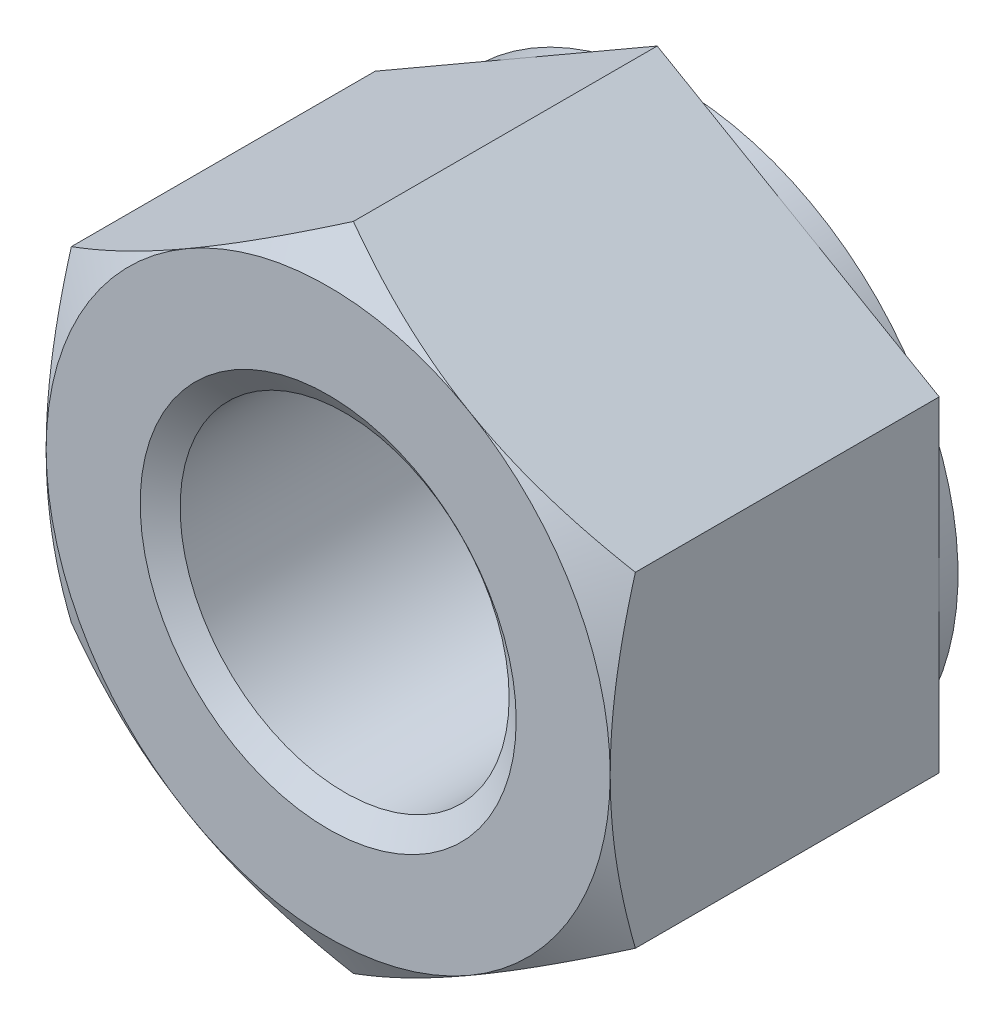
ISO-10303-21;
HEADER;
FILE_DESCRIPTION(('STEP AP214'),'2;1');
FILE_NAME('part.step','',(''),(''),'','','');
FILE_SCHEMA(('AUTOMOTIVE_DESIGN { 1 0 10303 214 1 1 1 1 }'));
ENDSEC;
DATA;
#1=APPLICATION_CONTEXT('core data for automotive mechanical design processes');
#2=APPLICATION_PROTOCOL_DEFINITION('international standard','automotive_design',2000,#1);
#3=PRODUCT_CONTEXT('',#1,'mechanical');
#4=PRODUCT('Part','Part','',(#3));
#5=PRODUCT_RELATED_PRODUCT_CATEGORY('part','',(#4));
#6=PRODUCT_DEFINITION_FORMATION('','',#4);
#7=PRODUCT_DEFINITION_CONTEXT('part definition',#1,'design');
#8=PRODUCT_DEFINITION('design','',#6,#7);
#9=PRODUCT_DEFINITION_SHAPE('','',#8);
#10=(LENGTH_UNIT() NAMED_UNIT(*) SI_UNIT(.MILLI.,.METRE.));
#11=(NAMED_UNIT(*) PLANE_ANGLE_UNIT() SI_UNIT($,.RADIAN.));
#12=(NAMED_UNIT(*) SI_UNIT($,.STERADIAN.) SOLID_ANGLE_UNIT());
#13=UNCERTAINTY_MEASURE_WITH_UNIT(LENGTH_MEASURE(1.E-05),#10,'distance_accuracy_value','');
#14=(GEOMETRIC_REPRESENTATION_CONTEXT(3) GLOBAL_UNCERTAINTY_ASSIGNED_CONTEXT((#13)) GLOBAL_UNIT_ASSIGNED_CONTEXT((#10,
#11,#12)) REPRESENTATION_CONTEXT('',''));
#15=CARTESIAN_POINT('',(0.,0.,0.));
#16=DIRECTION('',(0.,0.,1.));
#17=DIRECTION('',(1.,0.,0.));
#18=AXIS2_PLACEMENT_3D('',#15,#16,#17);
#19=CARTESIAN_POINT('',(0.,0.,-14.8));
#20=DIRECTION('',(0.,0.,1.));
#21=DIRECTION('',(1.,0.,0.));
#22=AXIS2_PLACEMENT_3D('',#19,#20,#21);
#23=CYLINDRICAL_SURFACE('',#22,7.);
#24=CARTESIAN_POINT('',(0.,0.,-0.700207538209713));
#25=DIRECTION('',(0.,0.,1.));
#26=DIRECTION('',(1.,0.,0.));
#27=AXIS2_PLACEMENT_3D('',#24,#25,#26);
#28=CIRCLE('',#27,7.);
#29=CARTESIAN_POINT('',(7.,0.,-0.700207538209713));
#30=VERTEX_POINT('',#29);
#31=EDGE_CURVE('E151',#30,#30,#28,.F.);
#32=ORIENTED_EDGE('',*,*,#31,.F.);
#33=EDGE_LOOP('',(#32));
#34=FACE_BOUND('',#33,.T.);
#35=CARTESIAN_POINT('',(0.,0.,-14.0743924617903));
#36=DIRECTION('',(0.,0.,-1.));
#37=DIRECTION('',(-1.,0.,0.));
#38=AXIS2_PLACEMENT_3D('',#35,#36,#37);
#39=CIRCLE('',#38,7.);
#40=CARTESIAN_POINT('',(-7.,0.,-14.0743924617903));
#41=VERTEX_POINT('',#40);
#42=EDGE_CURVE('E39',#41,#41,#39,.F.);
#43=ORIENTED_EDGE('',*,*,#42,.F.);
#44=EDGE_LOOP('',(#43));
#45=FACE_BOUND('',#44,.T.);
#46=ADVANCED_FACE('F34',(#34,#45),#23,.F.);
#47=CARTESIAN_POINT('',(0.,13.856406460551,-14.8));
#48=DIRECTION('',(0.,0.,-1.));
#49=DIRECTION('',(-1.,0.,0.));
#50=AXIS2_PLACEMENT_3D('',#47,#48,#49);
#51=PLANE('',#50);
#52=CARTESIAN_POINT('',(0.,0.,-14.8));
#53=DIRECTION('',(0.,0.,-1.));
#54=DIRECTION('',(-1.,0.,0.));
#55=AXIS2_PLACEMENT_3D('',#52,#53,#54);
#56=CIRCLE('',#55,12.);
#57=CARTESIAN_POINT('',(-12.,0.,-14.8));
#58=VERTEX_POINT('',#57);
#59=EDGE_CURVE('E278',#58,#58,#56,.F.);
#60=ORIENTED_EDGE('',*,*,#59,.F.);
#61=EDGE_LOOP('',(#60));
#62=FACE_BOUND('',#61,.T.);
#63=CARTESIAN_POINT('',(0.,0.,-14.8));
#64=DIRECTION('',(0.,0.,-1.));
#65=DIRECTION('',(-1.,0.,0.));
#66=AXIS2_PLACEMENT_3D('',#63,#64,#65);
#67=CIRCLE('',#66,8.);
#68=CARTESIAN_POINT('',(-8.,0.,-14.8));
#69=VERTEX_POINT('',#68);
#70=EDGE_CURVE('E298',#69,#69,#67,.F.);
#71=ORIENTED_EDGE('',*,*,#70,.T.);
#72=EDGE_LOOP('',(#71));
#73=FACE_BOUND('',#72,.T.);
#74=ADVANCED_FACE('F231',(#62,#73),#51,.T.);
#75=CARTESIAN_POINT('',(0.,13.856406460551,0.));
#76=DIRECTION('',(0.,0.,-1.));
#77=DIRECTION('',(-1.,0.,0.));
#78=AXIS2_PLACEMENT_3D('',#75,#76,#77);
#79=PLANE('',#78);
#80=CARTESIAN_POINT('',(0.,0.,0.));
#81=DIRECTION('',(0.,0.,-1.));
#82=DIRECTION('',(-1.,0.,0.));
#83=AXIS2_PLACEMENT_3D('',#80,#81,#82);
#84=CIRCLE('',#83,12.);
#85=CARTESIAN_POINT('',(-6.00000000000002,10.3923048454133,0.));
#86=VERTEX_POINT('',#85);
#87=CARTESIAN_POINT('',(-12.,0.,0.));
#88=VERTEX_POINT('',#87);
#89=EDGE_CURVE('E46',#86,#88,#84,.F.);
#90=ORIENTED_EDGE('',*,*,#89,.T.);
#91=CARTESIAN_POINT('',(-6.00000000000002,-10.3923048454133,0.));
#92=VERTEX_POINT('',#91);
#93=EDGE_CURVE('E12',#88,#92,#84,.F.);
#94=ORIENTED_EDGE('',*,*,#93,.T.);
#95=CARTESIAN_POINT('',(6.00000000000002,-10.3923048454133,0.));
#96=VERTEX_POINT('',#95);
#97=EDGE_CURVE('E44',#92,#96,#84,.F.);
#98=ORIENTED_EDGE('',*,*,#97,.T.);
#99=CARTESIAN_POINT('',(12.,0.,0.));
#100=VERTEX_POINT('',#99);
#101=EDGE_CURVE('E130',#96,#100,#84,.F.);
#102=ORIENTED_EDGE('',*,*,#101,.T.);
#103=CARTESIAN_POINT('',(0.,0.,0.));
#104=DIRECTION('',(0.,0.,1.));
#105=DIRECTION('',(1.,0.,0.));
#106=AXIS2_PLACEMENT_3D('',#103,#104,#105);
#107=CIRCLE('',#106,12.);
#108=CARTESIAN_POINT('',(6.00000000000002,10.3923048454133,0.));
#109=VERTEX_POINT('',#108);
#110=EDGE_CURVE('E142',#100,#109,#107,.T.);
#111=ORIENTED_EDGE('',*,*,#110,.T.);
#112=EDGE_CURVE('E157',#109,#86,#84,.F.);
#113=ORIENTED_EDGE('',*,*,#112,.T.);
#114=EDGE_LOOP('',(#90,#94,#98,#102,#111,#113));
#115=FACE_BOUND('',#114,.T.);
#116=CARTESIAN_POINT('',(0.,0.,0.));
#117=DIRECTION('',(0.,0.,1.));
#118=DIRECTION('',(1.,0.,0.));
#119=AXIS2_PLACEMENT_3D('',#116,#117,#118);
#120=CIRCLE('',#119,8.);
#121=CARTESIAN_POINT('',(8.,0.,0.));
#122=VERTEX_POINT('',#121);
#123=EDGE_CURVE('E297',#122,#122,#120,.T.);
#124=ORIENTED_EDGE('',*,*,#123,.F.);
#125=EDGE_LOOP('',(#124));
#126=FACE_BOUND('',#125,.T.);
#127=ADVANCED_FACE('F154',(#115,#126),#79,.F.);
#128=CARTESIAN_POINT('',(0.,13.856406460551,-14.8));
#129=DIRECTION('',(-0.500000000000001,0.866025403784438,0.));
#130=DIRECTION('',(-0.866025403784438,-0.500000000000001,0.));
#131=AXIS2_PLACEMENT_3D('',#128,#129,#130);
#132=PLANE('',#131);
#133=DIRECTION('',(0.,0.,1.));
#134=VECTOR('',#133,1.);
#135=CARTESIAN_POINT('',(-12.,6.9282032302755,-14.8));
#136=LINE('',#135,#134);
#137=CARTESIAN_POINT('',(-12.,6.9282032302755,-14.));
#138=VERTEX_POINT('',#137);
#139=CARTESIAN_POINT('',(-12.,6.9282032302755,-1.0717967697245));
#140=VERTEX_POINT('',#139);
#141=EDGE_CURVE('E287',#138,#140,#136,.T.);
#142=ORIENTED_EDGE('',*,*,#141,.T.);
#143=CARTESIAN_POINT('',(-12.0002,6.92808776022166,-1.07186343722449));
#144=CARTESIAN_POINT('',(-11.7364142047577,7.08038456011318,-0.983949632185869));
#145=CARTESIAN_POINT('',(-11.4716448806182,7.2332492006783,-0.900025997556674));
#146=CARTESIAN_POINT('',(-10.9399829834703,7.54020434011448,-0.741266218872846));
#147=CARTESIAN_POINT('',(-10.6730897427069,7.69429522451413,-0.666433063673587));
#148=CARTESIAN_POINT('',(-9.86810959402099,8.15905073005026,-0.457017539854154));
#149=CARTESIAN_POINT('',(-9.3268449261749,8.47155003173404,-0.337903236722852));
#150=CARTESIAN_POINT('',(-8.516867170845,8.93919090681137,-0.198231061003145));
#151=CARTESIAN_POINT('',(-8.25057389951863,9.09293539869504,-0.158443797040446));
#152=CARTESIAN_POINT('',(-7.71675440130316,9.40113622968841,-0.0917233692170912));
#153=CARTESIAN_POINT('',(-7.44922815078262,9.55559258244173,-0.0647904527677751));
#154=CARTESIAN_POINT('',(-6.91372963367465,9.86476279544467,-0.0244685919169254));
#155=CARTESIAN_POINT('',(-6.64575827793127,10.0194761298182,-0.0110635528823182));
#156=CARTESIAN_POINT('',(-6.10956726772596,10.3290461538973,0.00191690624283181));
#157=CARTESIAN_POINT('',(-5.84134762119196,10.4839028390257,0.0014927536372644));
#158=CARTESIAN_POINT('',(-5.33991062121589,10.7734076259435,-0.0122200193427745));
#159=CARTESIAN_POINT('',(-5.10665750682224,10.908076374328,-0.0238359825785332));
#160=CARTESIAN_POINT('',(-4.64068775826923,11.1771041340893,-0.0573080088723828));
#161=CARTESIAN_POINT('',(-4.40797116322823,11.3114631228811,-0.0791647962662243));
#162=CARTESIAN_POINT('',(-3.94320092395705,11.5797983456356,-0.132737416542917));
#163=CARTESIAN_POINT('',(-3.71114798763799,11.7137741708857,-0.164461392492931));
#164=CARTESIAN_POINT('',(-3.24813003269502,11.9810977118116,-0.237211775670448));
#165=CARTESIAN_POINT('',(-3.01716508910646,12.1144453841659,-0.278238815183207));
#166=CARTESIAN_POINT('',(-2.31605804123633,12.5192297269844,-0.416311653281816));
#167=CARTESIAN_POINT('',(-1.84794625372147,12.789494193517,-0.52712488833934));
#168=CARTESIAN_POINT('',(-0.918702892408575,13.3259930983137,-0.778625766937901));
#169=CARTESIAN_POINT('',(-0.457559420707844,13.5922344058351,-0.919254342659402));
#170=CARTESIAN_POINT('',(0.000200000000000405,13.8565219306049,-1.0718634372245));
#171=B_SPLINE_CURVE_WITH_KNOTS('',3,(#143,#144,#145,#146,#147,#148,#149,#150,#151,#152,#153,
#154,#155,#156,#157,#158,#159,#160,#161,#162,#163,#164,#165,#166,#167,#168,#169,#170),
.UNSPECIFIED.,.F.,.F.,(4,2,2,2,2,2,2,2,2,2,2,2,2,4),(0.,0.951004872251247,1.90232158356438,
3.80900466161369,4.73894551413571,5.6689042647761,6.59775529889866,7.52657763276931,
8.3351464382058,9.1437724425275,9.95306755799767,10.7624176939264,12.4167102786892,
14.0677556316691),.UNSPECIFIED.);
#172=EDGE_CURVE('E58',#140,#86,#171,.T.);
#173=ORIENTED_EDGE('',*,*,#172,.T.);
#174=CARTESIAN_POINT('',(0.,13.856406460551,-1.0717967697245));
#175=VERTEX_POINT('',#174);
#176=EDGE_CURVE('E166',#86,#175,#171,.T.);
#177=ORIENTED_EDGE('',*,*,#176,.T.);
#178=DIRECTION('',(0.,0.,1.));
#179=VECTOR('',#178,1.);
#180=CARTESIAN_POINT('',(0.,13.856406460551,-14.8));
#181=LINE('',#180,#179);
#182=CARTESIAN_POINT('',(0.,13.856406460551,-14.));
#183=VERTEX_POINT('',#182);
#184=EDGE_CURVE('E275',#183,#175,#181,.T.);
#185=ORIENTED_EDGE('',*,*,#184,.F.);
#186=DIRECTION('',(-0.866025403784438,-0.500000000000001,0.));
#187=VECTOR('',#186,1.);
#188=CARTESIAN_POINT('',(0.,13.856406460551,-14.));
#189=LINE('',#188,#187);
#190=CARTESIAN_POINT('',(-6.00000000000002,10.3923048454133,-14.));
#191=VERTEX_POINT('',#190);
#192=EDGE_CURVE('E263',#183,#191,#189,.T.);
#193=ORIENTED_EDGE('',*,*,#192,.T.);
#194=EDGE_CURVE('E259',#191,#138,#189,.T.);
#195=ORIENTED_EDGE('',*,*,#194,.T.);
#196=EDGE_LOOP('',(#142,#173,#177,#185,#193,#195));
#197=FACE_BOUND('',#196,.T.);
#198=ADVANCED_FACE('F36',(#197),#132,.T.);
#199=CARTESIAN_POINT('',(12.,6.9282032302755,-14.8));
#200=DIRECTION('',(0.500000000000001,0.866025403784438,0.));
#201=DIRECTION('',(-0.866025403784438,0.500000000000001,0.));
#202=AXIS2_PLACEMENT_3D('',#199,#200,#201);
#203=PLANE('',#202);
#204=ORIENTED_EDGE('',*,*,#184,.T.);
#205=CARTESIAN_POINT('',(-0.000200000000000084,13.8565219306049,-1.0718634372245));
#206=CARTESIAN_POINT('',(0.263585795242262,13.7042251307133,-0.983949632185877));
#207=CARTESIAN_POINT('',(0.528355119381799,13.5513604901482,-0.900025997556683));
#208=CARTESIAN_POINT('',(1.06001701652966,13.244405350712,-0.741266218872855));
#209=CARTESIAN_POINT('',(1.32691025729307,13.0903144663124,-0.666433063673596));
#210=CARTESIAN_POINT('',(2.13189040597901,12.6255589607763,-0.457017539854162));
#211=CARTESIAN_POINT('',(2.6731550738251,12.3130596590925,-0.337903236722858));
#212=CARTESIAN_POINT('',(3.483132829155,11.8454187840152,-0.198231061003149));
#213=CARTESIAN_POINT('',(3.74942610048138,11.6916742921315,-0.158443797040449));
#214=CARTESIAN_POINT('',(4.28324559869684,11.3834734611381,-0.0917233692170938));
#215=CARTESIAN_POINT('',(4.55077184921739,11.2290171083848,-0.0647904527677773));
#216=CARTESIAN_POINT('',(5.08627036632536,10.9198468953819,-0.0244685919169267));
#217=CARTESIAN_POINT('',(5.35424172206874,10.7651335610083,-0.011063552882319));
#218=CARTESIAN_POINT('',(5.89043273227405,10.4555635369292,0.00191690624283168));
#219=CARTESIAN_POINT('',(6.15865237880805,10.3007068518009,0.00149275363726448));
#220=CARTESIAN_POINT('',(6.66008937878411,10.011202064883,-0.0122200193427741));
#221=CARTESIAN_POINT('',(6.89334249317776,9.87653331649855,-0.0238359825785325));
#222=CARTESIAN_POINT('',(7.35931224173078,9.60750555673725,-0.0573080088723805));
#223=CARTESIAN_POINT('',(7.59202883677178,9.47314656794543,-0.0791647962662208));
#224=CARTESIAN_POINT('',(8.05679907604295,9.20481134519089,-0.132737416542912));
#225=CARTESIAN_POINT('',(8.28885201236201,9.07083551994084,-0.164461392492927));
#226=CARTESIAN_POINT('',(8.75186996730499,8.80351197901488,-0.237211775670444));
#227=CARTESIAN_POINT('',(8.98283491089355,8.67016430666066,-0.278238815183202));
#228=CARTESIAN_POINT('',(9.68394195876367,8.26537996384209,-0.416311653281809));
#229=CARTESIAN_POINT('',(10.1520537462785,7.99511549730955,-0.527124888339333));
#230=CARTESIAN_POINT('',(11.0812971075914,7.45861659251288,-0.778625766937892));
#231=CARTESIAN_POINT('',(11.5424405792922,7.19237528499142,-0.919254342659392));
#232=CARTESIAN_POINT('',(12.0002,6.92808776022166,-1.07186343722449));
#233=B_SPLINE_CURVE_WITH_KNOTS('',3,(#205,#206,#207,#208,#209,#210,#211,#212,#213,#214,#215,
#216,#217,#218,#219,#220,#221,#222,#223,#224,#225,#226,#227,#228,#229,#230,#231,#232),
.UNSPECIFIED.,.F.,.F.,(4,2,2,2,2,2,2,2,2,2,2,2,2,4),(0.,0.951004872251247,1.90232158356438,
3.8090046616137,4.73894551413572,5.66890426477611,6.59775529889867,7.52657763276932,
8.3351464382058,9.14377244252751,9.95306755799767,10.7624176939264,12.4167102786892,
14.0677556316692),.UNSPECIFIED.);
#234=EDGE_CURVE('E163',#175,#109,#233,.T.);
#235=ORIENTED_EDGE('',*,*,#234,.T.);
#236=CARTESIAN_POINT('',(12.,6.92820323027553,-1.0717967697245));
#237=VERTEX_POINT('',#236);
#238=EDGE_CURVE('E145',#109,#237,#233,.T.);
#239=ORIENTED_EDGE('',*,*,#238,.T.);
#240=DIRECTION('',(0.,0.,1.));
#241=VECTOR('',#240,1.);
#242=CARTESIAN_POINT('',(12.,6.9282032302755,-14.8));
#243=LINE('',#242,#241);
#244=CARTESIAN_POINT('',(12.,6.9282032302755,-14.));
#245=VERTEX_POINT('',#244);
#246=EDGE_CURVE('E162',#245,#237,#243,.T.);
#247=ORIENTED_EDGE('',*,*,#246,.F.);
#248=DIRECTION('',(-0.866025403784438,0.500000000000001,0.));
#249=VECTOR('',#248,1.);
#250=CARTESIAN_POINT('',(12.,6.9282032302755,-14.));
#251=LINE('',#250,#249);
#252=CARTESIAN_POINT('',(6.00000000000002,10.3923048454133,-14.));
#253=VERTEX_POINT('',#252);
#254=EDGE_CURVE('E271',#245,#253,#251,.T.);
#255=ORIENTED_EDGE('',*,*,#254,.T.);
#256=EDGE_CURVE('E267',#253,#183,#251,.T.);
#257=ORIENTED_EDGE('',*,*,#256,.T.);
#258=EDGE_LOOP('',(#204,#235,#239,#247,#255,#257));
#259=FACE_BOUND('',#258,.T.);
#260=ADVANCED_FACE('F243',(#259),#203,.T.);
#261=CARTESIAN_POINT('',(12.,6.9282032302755,-14.8));
#262=DIRECTION('',(-1.,0.,0.));
#263=DIRECTION('',(0.,0.,1.));
#264=AXIS2_PLACEMENT_3D('',#261,#262,#263);
#265=PLANE('',#264);
#266=CARTESIAN_POINT('',(12.,-18.3746159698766,-5.74232046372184));
#267=CARTESIAN_POINT('',(12.,-18.1111918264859,-5.61498513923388));
#268=CARTESIAN_POINT('',(12.,-17.8474492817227,-5.48830883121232));
#269=CARTESIAN_POINT('',(12.,-17.3192601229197,-5.23642551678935));
#270=CARTESIAN_POINT('',(12.,-17.0548135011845,-5.11121852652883));
#271=CARTESIAN_POINT('',(12.,-16.2602391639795,-4.73799215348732));
#272=CARTESIAN_POINT('',(12.,-15.7289626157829,-4.49240888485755));
#273=CARTESIAN_POINT('',(12.,-14.659698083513,-4.00791887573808));
#274=CARTESIAN_POINT('',(12.,-14.1216890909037,-3.7690583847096));
#275=CARTESIAN_POINT('',(12.,-13.0412497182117,-3.30159295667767));
#276=CARTESIAN_POINT('',(12.,-12.4988195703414,-3.07298748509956));
#277=CARTESIAN_POINT('',(12.,-11.4019415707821,-2.62605165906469));
#278=CARTESIAN_POINT('',(12.,-10.8474279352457,-2.40788190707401));
#279=CARTESIAN_POINT('',(12.,-9.73185625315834,-1.98862863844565));
#280=CARTESIAN_POINT('',(12.,-9.17079748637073,-1.78754702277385));
#281=CARTESIAN_POINT('',(12.,-8.04241377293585,-1.40787575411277));
#282=CARTESIAN_POINT('',(12.,-7.4751050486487,-1.22923828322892));
#283=CARTESIAN_POINT('',(12.,-6.33236790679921,-0.900248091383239));
#284=CARTESIAN_POINT('',(12.,-5.75694211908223,-0.749886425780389));
#285=CARTESIAN_POINT('',(12.,-4.88760620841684,-0.551055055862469));
#286=CARTESIAN_POINT('',(12.,-4.59673300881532,-0.489219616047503));
#287=CARTESIAN_POINT('',(12.,-4.01305048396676,-0.375428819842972));
#288=CARTESIAN_POINT('',(12.,-3.72024120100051,-0.323473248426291));
#289=CARTESIAN_POINT('',(12.,-3.13287727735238,-0.23036239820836));
#290=CARTESIAN_POINT('',(12.,-2.83832249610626,-0.189208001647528));
#291=CARTESIAN_POINT('',(12.,-2.24782315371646,-0.118528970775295));
#292=CARTESIAN_POINT('',(12.,-1.9518786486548,-0.0890038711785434));
#293=CARTESIAN_POINT('',(12.,-1.36089234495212,-0.0423753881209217));
#294=CARTESIAN_POINT('',(12.,-1.06585670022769,-0.0251945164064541));
#295=CARTESIAN_POINT('',(12.,-0.475323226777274,-0.003345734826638));
#296=CARTESIAN_POINT('',(12.,-0.179825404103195,0.00132233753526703));
#297=CARTESIAN_POINT('',(12.,0.411018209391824,-0.0019652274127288));
#298=CARTESIAN_POINT('',(12.,0.706364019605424,-0.00991732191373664));
#299=CARTESIAN_POINT('',(12.,1.29646300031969,-0.0382476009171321));
#300=CARTESIAN_POINT('',(12.,1.59121614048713,-0.0586264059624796));
#301=CARTESIAN_POINT('',(12.,2.30560702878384,-0.12265279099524));
#302=CARTESIAN_POINT('',(12.,2.72469590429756,-0.172526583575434));
#303=CARTESIAN_POINT('',(12.,3.55966217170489,-0.294627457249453));
#304=CARTESIAN_POINT('',(12.,3.97553865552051,-0.366860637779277));
#305=CARTESIAN_POINT('',(12.,4.80373712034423,-0.531118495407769));
#306=CARTESIAN_POINT('',(12.,5.21605535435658,-0.623161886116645));
#307=CARTESIAN_POINT('',(12.,6.03644960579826,-0.824231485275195));
#308=CARTESIAN_POINT('',(12.,6.44452601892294,-0.933256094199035));
#309=CARTESIAN_POINT('',(12.,7.26648771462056,-1.16853096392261));
#310=CARTESIAN_POINT('',(12.,7.68027019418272,-1.29513795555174));
#311=CARTESIAN_POINT('',(12.,8.5034606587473,-1.5608576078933));
#312=CARTESIAN_POINT('',(12.,8.91287144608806,-1.69996164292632));
#313=CARTESIAN_POINT('',(12.,9.72567950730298,-1.98781971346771));
#314=CARTESIAN_POINT('',(12.,10.1290976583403,-2.1365150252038));
#315=CARTESIAN_POINT('',(12.,10.7318330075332,-2.36605061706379));
#316=CARTESIAN_POINT('',(12.,10.9323890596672,-2.44366199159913));
#317=CARTESIAN_POINT('',(12.,11.3327210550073,-2.60085858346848));
#318=CARTESIAN_POINT('',(12.,11.5324970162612,-2.68044375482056));
#319=CARTESIAN_POINT('',(12.,11.7319109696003,-2.76092701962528));
#320=B_SPLINE_CURVE_WITH_KNOTS('',3,(#266,#267,#268,#269,#270,#271,#272,#273,#274,#275,#276,
#277,#278,#279,#280,#281,#282,#283,#284,#285,#286,#287,#288,#289,#290,#291,#292,#293,#294,#295,
#296,#297,#298,#299,#300,#301,#302,#303,#304,#305,#306,#307,#308,#309,#310,#311,#312,#313,#314,
#315,#316,#317,#318,#319),.UNSPECIFIED.,.F.,.F.,(4,2,2,2,2,2,2,2,2,2,2,2,2,2,2,2,2,2,2,2,2,2,2,
2,2,2,4),(0.,0.877756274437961,1.75552218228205,3.51133949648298,5.27720464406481,
7.04297763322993,8.83042883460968,10.6180786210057,12.4018527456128,14.1850616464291,
15.0770405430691,15.9690000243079,16.861032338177,17.7530289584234,18.63937614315,
19.5257118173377,20.4117987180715,21.2979298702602,22.5633628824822,23.8291413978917,
25.0961209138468,26.3629811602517,27.6608948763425,28.9579195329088,30.2476436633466,
30.8927835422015,31.5379084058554),.UNSPECIFIED.);
#321=CARTESIAN_POINT('',(12.,-6.92820323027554,-1.0717967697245));
#322=VERTEX_POINT('',#321);
#323=EDGE_CURVE('E126',#322,#100,#320,.T.);
#324=ORIENTED_EDGE('',*,*,#323,.F.);
#325=DIRECTION('',(0.,0.,1.));
#326=VECTOR('',#325,1.);
#327=CARTESIAN_POINT('',(12.,-6.92820323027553,-14.8));
#328=LINE('',#327,#326);
#329=CARTESIAN_POINT('',(12.,-6.92820323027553,-14.));
#330=VERTEX_POINT('',#329);
#331=EDGE_CURVE('E280',#330,#322,#328,.T.);
#332=ORIENTED_EDGE('',*,*,#331,.F.);
#333=DIRECTION('',(0.,-1.,0.));
#334=VECTOR('',#333,1.);
#335=CARTESIAN_POINT('',(12.,6.9282032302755,-14.));
#336=LINE('',#335,#334);
#337=CARTESIAN_POINT('',(12.,0.,-14.));
#338=VERTEX_POINT('',#337);
#339=EDGE_CURVE('E272',#338,#330,#336,.T.);
#340=ORIENTED_EDGE('',*,*,#339,.F.);
#341=EDGE_CURVE('E274',#245,#338,#336,.T.);
#342=ORIENTED_EDGE('',*,*,#341,.F.);
#343=ORIENTED_EDGE('',*,*,#246,.T.);
#344=EDGE_CURVE('E139',#100,#237,#320,.T.);
#345=ORIENTED_EDGE('',*,*,#344,.F.);
#346=EDGE_LOOP('',(#324,#332,#340,#342,#343,#345));
#347=FACE_BOUND('',#346,.T.);
#348=ADVANCED_FACE('F159',(#347),#265,.F.);
#349=CARTESIAN_POINT('',(0.,-13.8564064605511,-14.8));
#350=DIRECTION('',(0.500000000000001,-0.866025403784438,0.));
#351=DIRECTION('',(0.866025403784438,0.500000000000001,0.));
#352=AXIS2_PLACEMENT_3D('',#349,#350,#351);
#353=PLANE('',#352);
#354=ORIENTED_EDGE('',*,*,#331,.T.);
#355=CARTESIAN_POINT('',(12.0002,-6.9280877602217,-1.0718634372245));
#356=CARTESIAN_POINT('',(11.7364142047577,-7.08038456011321,-0.983949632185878));
#357=CARTESIAN_POINT('',(11.4716448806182,-7.23324920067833,-0.900025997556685));
#358=CARTESIAN_POINT('',(10.9399829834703,-7.54020434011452,-0.741266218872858));
#359=CARTESIAN_POINT('',(10.6730897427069,-7.69429522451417,-0.666433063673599));
#360=CARTESIAN_POINT('',(9.86810959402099,-8.1590507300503,-0.457017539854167));
#361=CARTESIAN_POINT('',(9.32684492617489,-8.47155003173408,-0.337903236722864));
#362=CARTESIAN_POINT('',(8.516867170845,-8.9391909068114,-0.198231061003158));
#363=CARTESIAN_POINT('',(8.25057389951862,-9.09293539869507,-0.158443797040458));
#364=CARTESIAN_POINT('',(7.71675440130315,-9.40113622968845,-0.0917233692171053));
#365=CARTESIAN_POINT('',(7.44922815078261,-9.55559258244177,-0.0647904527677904));
#366=CARTESIAN_POINT('',(6.91372963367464,-9.8647627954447,-0.0244685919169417));
#367=CARTESIAN_POINT('',(6.64575827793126,-10.0194761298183,-0.0110635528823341));
#368=CARTESIAN_POINT('',(6.10956726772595,-10.3290461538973,0.00191690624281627));
#369=CARTESIAN_POINT('',(5.84134762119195,-10.4839028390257,0.00149275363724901));
#370=CARTESIAN_POINT('',(5.33991062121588,-10.7734076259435,-0.0122200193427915));
#371=CARTESIAN_POINT('',(5.10665750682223,-10.908076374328,-0.0238359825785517));
#372=CARTESIAN_POINT('',(4.64068775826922,-11.1771041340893,-0.0573080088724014));
#373=CARTESIAN_POINT('',(4.40797116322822,-11.3114631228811,-0.0791647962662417));
#374=CARTESIAN_POINT('',(3.94320092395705,-11.5797983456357,-0.132737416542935));
#375=CARTESIAN_POINT('',(3.71114798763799,-11.7137741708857,-0.16446139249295));
#376=CARTESIAN_POINT('',(3.24813003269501,-11.9810977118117,-0.237211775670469));
#377=CARTESIAN_POINT('',(3.01716508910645,-12.1144453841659,-0.278238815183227));
#378=CARTESIAN_POINT('',(2.31605804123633,-12.5192297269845,-0.416311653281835));
#379=CARTESIAN_POINT('',(1.84794625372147,-12.789494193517,-0.527124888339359));
#380=CARTESIAN_POINT('',(0.918702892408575,-13.3259930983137,-0.77862576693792));
#381=CARTESIAN_POINT('',(0.457559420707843,-13.5922344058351,-0.919254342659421));
#382=CARTESIAN_POINT('',(-0.000200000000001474,-13.8565219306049,-1.07186343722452));
#383=B_SPLINE_CURVE_WITH_KNOTS('',3,(#355,#356,#357,#358,#359,#360,#361,#362,#363,#364,#365,
#366,#367,#368,#369,#370,#371,#372,#373,#374,#375,#376,#377,#378,#379,#380,#381,#382),
.UNSPECIFIED.,.F.,.F.,(4,2,2,2,2,2,2,2,2,2,2,2,2,4),(0.,0.951004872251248,1.90232158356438,
3.8090046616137,4.73894551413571,5.66890426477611,6.59775529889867,7.52657763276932,
8.3351464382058,9.14377244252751,9.95306755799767,10.7624176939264,12.4167102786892,
14.0677556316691),.UNSPECIFIED.);
#384=EDGE_CURVE('E133',#322,#96,#383,.T.);
#385=ORIENTED_EDGE('',*,*,#384,.T.);
#386=CARTESIAN_POINT('',(0.,-13.856406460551,-1.0717967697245));
#387=VERTEX_POINT('',#386);
#388=EDGE_CURVE('E173',#96,#387,#383,.T.);
#389=ORIENTED_EDGE('',*,*,#388,.T.);
#390=DIRECTION('',(0.,0.,1.));
#391=VECTOR('',#390,1.);
#392=CARTESIAN_POINT('',(0.,-13.8564064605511,-14.8));
#393=LINE('',#392,#391);
#394=CARTESIAN_POINT('',(0.,-13.8564064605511,-14.));
#395=VERTEX_POINT('',#394);
#396=EDGE_CURVE('E282',#395,#387,#393,.T.);
#397=ORIENTED_EDGE('',*,*,#396,.F.);
#398=DIRECTION('',(0.866025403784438,0.500000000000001,0.));
#399=VECTOR('',#398,1.);
#400=CARTESIAN_POINT('',(0.,-13.8564064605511,-14.));
#401=LINE('',#400,#399);
#402=CARTESIAN_POINT('',(6.00000000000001,-10.3923048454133,-14.));
#403=VERTEX_POINT('',#402);
#404=EDGE_CURVE('E264',#395,#403,#401,.T.);
#405=ORIENTED_EDGE('',*,*,#404,.T.);
#406=EDGE_CURVE('E268',#403,#330,#401,.T.);
#407=ORIENTED_EDGE('',*,*,#406,.T.);
#408=EDGE_LOOP('',(#354,#385,#389,#397,#405,#407));
#409=FACE_BOUND('',#408,.T.);
#410=ADVANCED_FACE('F216',(#409),#353,.T.);
#411=CARTESIAN_POINT('',(-12.,-6.92820323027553,-14.8));
#412=DIRECTION('',(-0.500000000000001,-0.866025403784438,0.));
#413=DIRECTION('',(0.866025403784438,-0.500000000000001,0.));
#414=AXIS2_PLACEMENT_3D('',#411,#412,#413);
#415=PLANE('',#414);
#416=ORIENTED_EDGE('',*,*,#396,.T.);
#417=CARTESIAN_POINT('',(0.000199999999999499,-13.8565219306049,-1.07186343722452));
#418=CARTESIAN_POINT('',(-0.263585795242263,-13.7042251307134,-0.983949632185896));
#419=CARTESIAN_POINT('',(-0.528355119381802,-13.5513604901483,-0.900025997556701));
#420=CARTESIAN_POINT('',(-1.06001701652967,-13.2444053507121,-0.741266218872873));
#421=CARTESIAN_POINT('',(-1.32691025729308,-13.0903144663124,-0.666433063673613));
#422=CARTESIAN_POINT('',(-2.13189040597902,-12.6255589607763,-0.457017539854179));
#423=CARTESIAN_POINT('',(-2.67315507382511,-12.3130596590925,-0.337903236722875));
#424=CARTESIAN_POINT('',(-3.48313282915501,-11.8454187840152,-0.198231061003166));
#425=CARTESIAN_POINT('',(-3.74942610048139,-11.6916742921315,-0.158443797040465));
#426=CARTESIAN_POINT('',(-4.28324559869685,-11.3834734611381,-0.0917233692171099));
#427=CARTESIAN_POINT('',(-4.5507718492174,-11.2290171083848,-0.0647904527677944));
#428=CARTESIAN_POINT('',(-5.08627036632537,-10.9198468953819,-0.0244685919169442));
#429=CARTESIAN_POINT('',(-5.35424172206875,-10.7651335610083,-0.0110635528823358));
#430=CARTESIAN_POINT('',(-5.89043273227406,-10.4555635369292,0.0019169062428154));
#431=CARTESIAN_POINT('',(-6.15865237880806,-10.3007068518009,0.00149275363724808));
#432=CARTESIAN_POINT('',(-6.66008937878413,-10.0112020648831,-0.0122200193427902));
#433=CARTESIAN_POINT('',(-6.89334249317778,-9.87653331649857,-0.0238359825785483));
#434=CARTESIAN_POINT('',(-7.35931224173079,-9.60750555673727,-0.0573080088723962));
#435=CARTESIAN_POINT('',(-7.59202883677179,-9.47314656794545,-0.0791647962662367));
#436=CARTESIAN_POINT('',(-8.05679907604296,-9.20481134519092,-0.132737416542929));
#437=CARTESIAN_POINT('',(-8.28885201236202,-9.07083551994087,-0.164461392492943));
#438=CARTESIAN_POINT('',(-8.75186996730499,-8.80351197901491,-0.23721177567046));
#439=CARTESIAN_POINT('',(-8.98283491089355,-8.67016430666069,-0.278238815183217));
#440=CARTESIAN_POINT('',(-9.68394195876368,-8.26537996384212,-0.416311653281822));
#441=CARTESIAN_POINT('',(-10.1520537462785,-7.99511549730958,-0.527124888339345));
#442=CARTESIAN_POINT('',(-11.0812971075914,-7.45861659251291,-0.778625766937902));
#443=CARTESIAN_POINT('',(-11.5424405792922,-7.19237528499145,-0.919254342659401));
#444=CARTESIAN_POINT('',(-12.0002,-6.92808776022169,-1.07186343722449));
#445=B_SPLINE_CURVE_WITH_KNOTS('',3,(#417,#418,#419,#420,#421,#422,#423,#424,#425,#426,#427,
#428,#429,#430,#431,#432,#433,#434,#435,#436,#437,#438,#439,#440,#441,#442,#443,#444),
.UNSPECIFIED.,.F.,.F.,(4,2,2,2,2,2,2,2,2,2,2,2,2,4),(0.,0.95100487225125,1.90232158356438,
3.8090046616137,4.73894551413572,5.66890426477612,6.59775529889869,7.52657763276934,
8.33514643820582,9.14377244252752,9.95306755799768,10.7624176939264,12.4167102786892,
14.0677556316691),.UNSPECIFIED.);
#446=EDGE_CURVE('E210',#387,#92,#445,.T.);
#447=ORIENTED_EDGE('',*,*,#446,.T.);
#448=CARTESIAN_POINT('',(-12.,-6.92820323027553,-1.0717967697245));
#449=VERTEX_POINT('',#448);
#450=EDGE_CURVE('E203',#92,#449,#445,.T.);
#451=ORIENTED_EDGE('',*,*,#450,.T.);
#452=DIRECTION('',(0.,0.,1.));
#453=VECTOR('',#452,1.);
#454=CARTESIAN_POINT('',(-12.,-6.92820323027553,-14.8));
#455=LINE('',#454,#453);
#456=CARTESIAN_POINT('',(-12.,-6.92820323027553,-14.));
#457=VERTEX_POINT('',#456);
#458=EDGE_CURVE('E285',#457,#449,#455,.T.);
#459=ORIENTED_EDGE('',*,*,#458,.F.);
#460=DIRECTION('',(0.866025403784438,-0.500000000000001,0.));
#461=VECTOR('',#460,1.);
#462=CARTESIAN_POINT('',(-12.,-6.92820323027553,-14.));
#463=LINE('',#462,#461);
#464=CARTESIAN_POINT('',(-6.00000000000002,-10.3923048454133,-14.));
#465=VERTEX_POINT('',#464);
#466=EDGE_CURVE('E254',#457,#465,#463,.T.);
#467=ORIENTED_EDGE('',*,*,#466,.T.);
#468=EDGE_CURVE('E260',#465,#395,#463,.T.);
#469=ORIENTED_EDGE('',*,*,#468,.T.);
#470=EDGE_LOOP('',(#416,#447,#451,#459,#467,#469));
#471=FACE_BOUND('',#470,.T.);
#472=ADVANCED_FACE('F212',(#471),#415,.T.);
#473=CARTESIAN_POINT('',(-12.,6.9282032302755,-14.8));
#474=DIRECTION('',(-1.,0.,0.));
#475=DIRECTION('',(0.,0.,1.));
#476=AXIS2_PLACEMENT_3D('',#473,#474,#475);
#477=PLANE('',#476);
#478=ORIENTED_EDGE('',*,*,#458,.T.);
#479=CARTESIAN_POINT('',(-12.,-18.3746159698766,-5.74232046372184));
#480=CARTESIAN_POINT('',(-12.,-18.1111918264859,-5.61498513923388));
#481=CARTESIAN_POINT('',(-12.,-17.8474492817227,-5.48830883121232));
#482=CARTESIAN_POINT('',(-12.,-17.3192601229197,-5.23642551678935));
#483=CARTESIAN_POINT('',(-12.,-17.0548135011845,-5.11121852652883));
#484=CARTESIAN_POINT('',(-12.,-16.2602391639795,-4.73799215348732));
#485=CARTESIAN_POINT('',(-12.,-15.7289626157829,-4.49240888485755));
#486=CARTESIAN_POINT('',(-12.,-14.659698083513,-4.00791887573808));
#487=CARTESIAN_POINT('',(-12.,-14.1216890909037,-3.7690583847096));
#488=CARTESIAN_POINT('',(-12.,-13.0412497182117,-3.30159295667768));
#489=CARTESIAN_POINT('',(-12.,-12.4988195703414,-3.07298748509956));
#490=CARTESIAN_POINT('',(-12.,-11.4019415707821,-2.62605165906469));
#491=CARTESIAN_POINT('',(-12.,-10.8474279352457,-2.40788190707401));
#492=CARTESIAN_POINT('',(-12.,-9.73185625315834,-1.98862863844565));
#493=CARTESIAN_POINT('',(-12.,-9.17079748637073,-1.78754702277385));
#494=CARTESIAN_POINT('',(-12.,-8.04241377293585,-1.40787575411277));
#495=CARTESIAN_POINT('',(-12.,-7.4751050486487,-1.22923828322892));
#496=CARTESIAN_POINT('',(-12.,-6.33236790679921,-0.900248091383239));
#497=CARTESIAN_POINT('',(-12.,-5.75694211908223,-0.749886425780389));
#498=CARTESIAN_POINT('',(-12.,-4.88760620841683,-0.551055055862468));
#499=CARTESIAN_POINT('',(-12.,-4.59673300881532,-0.489219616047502));
#500=CARTESIAN_POINT('',(-12.,-4.01305048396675,-0.375428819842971));
#501=CARTESIAN_POINT('',(-12.,-3.7202412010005,-0.32347324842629));
#502=CARTESIAN_POINT('',(-12.,-3.13287727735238,-0.230362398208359));
#503=CARTESIAN_POINT('',(-12.,-2.83832249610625,-0.189208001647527));
#504=CARTESIAN_POINT('',(-12.,-2.24782315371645,-0.118528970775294));
#505=CARTESIAN_POINT('',(-12.,-1.9518786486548,-0.0890038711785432));
#506=CARTESIAN_POINT('',(-12.,-1.36089234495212,-0.042375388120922));
#507=CARTESIAN_POINT('',(-12.,-1.06585670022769,-0.0251945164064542));
#508=CARTESIAN_POINT('',(-12.,-0.47532322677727,-0.00334573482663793));
#509=CARTESIAN_POINT('',(-12.,-0.179825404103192,0.00132233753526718));
#510=CARTESIAN_POINT('',(-12.,0.411018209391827,-0.00196522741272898));
#511=CARTESIAN_POINT('',(-12.,0.706364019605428,-0.00991732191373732));
#512=CARTESIAN_POINT('',(-12.,1.29646300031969,-0.0382476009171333));
#513=CARTESIAN_POINT('',(-12.,1.59121614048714,-0.0586264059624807));
#514=CARTESIAN_POINT('',(-12.,2.30560702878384,-0.122652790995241));
#515=CARTESIAN_POINT('',(-12.,2.72469590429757,-0.172526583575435));
#516=CARTESIAN_POINT('',(-12.,3.55966217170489,-0.294627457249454));
#517=CARTESIAN_POINT('',(-12.,3.97553865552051,-0.366860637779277));
#518=CARTESIAN_POINT('',(-12.,4.80373712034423,-0.531118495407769));
#519=CARTESIAN_POINT('',(-12.,5.21605535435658,-0.623161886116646));
#520=CARTESIAN_POINT('',(-12.,6.03644960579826,-0.824231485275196));
#521=CARTESIAN_POINT('',(-12.,6.44452601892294,-0.933256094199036));
#522=CARTESIAN_POINT('',(-12.,7.26648771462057,-1.16853096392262));
#523=CARTESIAN_POINT('',(-12.,7.68027019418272,-1.29513795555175));
#524=CARTESIAN_POINT('',(-12.,8.5034606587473,-1.5608576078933));
#525=CARTESIAN_POINT('',(-12.,8.91287144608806,-1.69996164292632));
#526=CARTESIAN_POINT('',(-12.,9.72567950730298,-1.98781971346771));
#527=CARTESIAN_POINT('',(-12.,10.1290976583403,-2.1365150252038));
#528=CARTESIAN_POINT('',(-12.,10.7318330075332,-2.36605061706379));
#529=CARTESIAN_POINT('',(-12.,10.9323890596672,-2.44366199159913));
#530=CARTESIAN_POINT('',(-12.,11.3327210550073,-2.60085858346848));
#531=CARTESIAN_POINT('',(-12.,11.5324970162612,-2.68044375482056));
#532=CARTESIAN_POINT('',(-12.,11.7319109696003,-2.76092701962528));
#533=B_SPLINE_CURVE_WITH_KNOTS('',3,(#479,#480,#481,#482,#483,#484,#485,#486,#487,#488,#489,
#490,#491,#492,#493,#494,#495,#496,#497,#498,#499,#500,#501,#502,#503,#504,#505,#506,#507,#508,
#509,#510,#511,#512,#513,#514,#515,#516,#517,#518,#519,#520,#521,#522,#523,#524,#525,#526,#527,
#528,#529,#530,#531,#532),.UNSPECIFIED.,.F.,.F.,(4,2,2,2,2,2,2,2,2,2,2,2,2,2,2,2,2,2,2,2,2,2,2,
2,2,2,4),(0.,0.877756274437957,1.75552218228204,3.51133949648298,5.27720464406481,
7.04297763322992,8.83042883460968,10.6180786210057,12.4018527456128,14.1850616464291,
15.0770405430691,15.9690000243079,16.861032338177,17.7530289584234,18.63937614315,
19.5257118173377,20.4117987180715,21.2979298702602,22.5633628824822,23.8291413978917,
25.0961209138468,26.3629811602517,27.6608948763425,28.9579195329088,30.2476436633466,
30.8927835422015,31.5379084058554),.UNSPECIFIED.);
#534=EDGE_CURVE('E211',#449,#88,#533,.T.);
#535=ORIENTED_EDGE('',*,*,#534,.T.);
#536=EDGE_CURVE('E150',#88,#140,#533,.T.);
#537=ORIENTED_EDGE('',*,*,#536,.T.);
#538=ORIENTED_EDGE('',*,*,#141,.F.);
#539=DIRECTION('',(0.,-1.,0.));
#540=VECTOR('',#539,1.);
#541=CARTESIAN_POINT('',(-12.,6.9282032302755,-14.));
#542=LINE('',#541,#540);
#543=CARTESIAN_POINT('',(-12.,0.,-14.));
#544=VERTEX_POINT('',#543);
#545=EDGE_CURVE('E294',#138,#544,#542,.T.);
#546=ORIENTED_EDGE('',*,*,#545,.T.);
#547=EDGE_CURVE('E292',#544,#457,#542,.T.);
#548=ORIENTED_EDGE('',*,*,#547,.T.);
#549=EDGE_LOOP('',(#478,#535,#537,#538,#546,#548));
#550=FACE_BOUND('',#549,.T.);
#551=ADVANCED_FACE('F215',(#550),#477,.T.);
#552=CARTESIAN_POINT('',(0.,23.856406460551,-14.));
#553=DIRECTION('',(0.,0.,-1.));
#554=DIRECTION('',(-1.,0.,0.));
#555=AXIS2_PLACEMENT_3D('',#552,#553,#554);
#556=PLANE('',#555);
#557=ORIENTED_EDGE('',*,*,#341,.T.);
#558=CARTESIAN_POINT('',(0.,0.,-14.));
#559=DIRECTION('',(0.,0.,1.));
#560=DIRECTION('',(1.,0.,0.));
#561=AXIS2_PLACEMENT_3D('',#558,#559,#560);
#562=CIRCLE('',#561,12.);
#563=EDGE_CURVE('E251',#338,#253,#562,.T.);
#564=ORIENTED_EDGE('',*,*,#563,.T.);
#565=ORIENTED_EDGE('',*,*,#254,.F.);
#566=EDGE_LOOP('',(#557,#564,#565));
#567=FACE_BOUND('',#566,.T.);
#568=ADVANCED_FACE('F221',(#567),#556,.T.);
#569=ORIENTED_EDGE('',*,*,#339,.T.);
#570=ORIENTED_EDGE('',*,*,#406,.F.);
#571=EDGE_CURVE('E256',#403,#338,#562,.T.);
#572=ORIENTED_EDGE('',*,*,#571,.T.);
#573=EDGE_LOOP('',(#569,#570,#572));
#574=FACE_BOUND('',#573,.T.);
#575=ADVANCED_FACE('F226',(#574),#556,.T.);
#576=EDGE_CURVE('E255',#253,#191,#562,.T.);
#577=ORIENTED_EDGE('',*,*,#576,.T.);
#578=ORIENTED_EDGE('',*,*,#192,.F.);
#579=ORIENTED_EDGE('',*,*,#256,.F.);
#580=EDGE_LOOP('',(#577,#578,#579));
#581=FACE_BOUND('',#580,.T.);
#582=ADVANCED_FACE('F433',(#581),#556,.T.);
#583=ORIENTED_EDGE('',*,*,#468,.F.);
#584=EDGE_CURVE('E505',#465,#403,#562,.T.);
#585=ORIENTED_EDGE('',*,*,#584,.T.);
#586=ORIENTED_EDGE('',*,*,#404,.F.);
#587=EDGE_LOOP('',(#583,#585,#586));
#588=FACE_BOUND('',#587,.T.);
#589=ADVANCED_FACE('F424',(#588),#556,.T.);
#590=EDGE_CURVE('E522',#191,#544,#562,.T.);
#591=ORIENTED_EDGE('',*,*,#590,.T.);
#592=ORIENTED_EDGE('',*,*,#545,.F.);
#593=ORIENTED_EDGE('',*,*,#194,.F.);
#594=EDGE_LOOP('',(#591,#592,#593));
#595=FACE_BOUND('',#594,.T.);
#596=ADVANCED_FACE('F408',(#595),#556,.T.);
#597=CARTESIAN_POINT('',(0.,0.,0.));
#598=DIRECTION('',(0.,0.,1.));
#599=DIRECTION('',(1.,0.,0.));
#600=AXIS2_PLACEMENT_3D('',#597,#598,#599);
#601=CYLINDRICAL_SURFACE('',#600,12.);
#602=ORIENTED_EDGE('',*,*,#59,.T.);
#603=EDGE_LOOP('',(#602));
#604=FACE_BOUND('',#603,.T.);
#605=ORIENTED_EDGE('',*,*,#576,.F.);
#606=ORIENTED_EDGE('',*,*,#563,.F.);
#607=ORIENTED_EDGE('',*,*,#571,.F.);
#608=ORIENTED_EDGE('',*,*,#584,.F.);
#609=EDGE_CURVE('E517',#544,#465,#562,.T.);
#610=ORIENTED_EDGE('',*,*,#609,.F.);
#611=ORIENTED_EDGE('',*,*,#590,.F.);
#612=EDGE_LOOP('',(#605,#606,#607,#608,#610,#611));
#613=FACE_BOUND('',#612,.T.);
#614=ADVANCED_FACE('F193',(#604,#613),#601,.T.);
#615=ORIENTED_EDGE('',*,*,#547,.F.);
#616=ORIENTED_EDGE('',*,*,#609,.T.);
#617=ORIENTED_EDGE('',*,*,#466,.F.);
#618=EDGE_LOOP('',(#615,#616,#617));
#619=FACE_BOUND('',#618,.T.);
#620=ADVANCED_FACE('F228',(#619),#556,.T.);
#621=CARTESIAN_POINT('',(0.,0.,0.));
#622=DIRECTION('',(0.,0.,-1.));
#623=DIRECTION('',(-1.,0.,0.));
#624=AXIS2_PLACEMENT_3D('',#621,#622,#623);
#625=CONICAL_SURFACE('',#624,12.,1.0471975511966);
#626=ORIENTED_EDGE('',*,*,#536,.F.);
#627=ORIENTED_EDGE('',*,*,#89,.F.);
#628=ORIENTED_EDGE('',*,*,#172,.F.);
#629=EDGE_LOOP('',(#626,#627,#628));
#630=FACE_BOUND('',#629,.T.);
#631=ADVANCED_FACE('F370',(#630),#625,.T.);
#632=ORIENTED_EDGE('',*,*,#112,.F.);
#633=ORIENTED_EDGE('',*,*,#234,.F.);
#634=ORIENTED_EDGE('',*,*,#176,.F.);
#635=EDGE_LOOP('',(#632,#633,#634));
#636=FACE_BOUND('',#635,.T.);
#637=ADVANCED_FACE('F191',(#636),#625,.T.);
#638=ORIENTED_EDGE('',*,*,#110,.F.);
#639=ORIENTED_EDGE('',*,*,#344,.T.);
#640=ORIENTED_EDGE('',*,*,#238,.F.);
#641=EDGE_LOOP('',(#638,#639,#640));
#642=FACE_BOUND('',#641,.T.);
#643=ADVANCED_FACE('F143',(#642),#625,.T.);
#644=ORIENTED_EDGE('',*,*,#323,.T.);
#645=ORIENTED_EDGE('',*,*,#101,.F.);
#646=ORIENTED_EDGE('',*,*,#384,.F.);
#647=EDGE_LOOP('',(#644,#645,#646));
#648=FACE_BOUND('',#647,.T.);
#649=ADVANCED_FACE('F128',(#648),#625,.T.);
#650=ORIENTED_EDGE('',*,*,#97,.F.);
#651=ORIENTED_EDGE('',*,*,#446,.F.);
#652=ORIENTED_EDGE('',*,*,#388,.F.);
#653=EDGE_LOOP('',(#650,#651,#652));
#654=FACE_BOUND('',#653,.T.);
#655=ADVANCED_FACE('F190',(#654),#625,.T.);
#656=ORIENTED_EDGE('',*,*,#93,.F.);
#657=ORIENTED_EDGE('',*,*,#534,.F.);
#658=ORIENTED_EDGE('',*,*,#450,.F.);
#659=EDGE_LOOP('',(#656,#657,#658));
#660=FACE_BOUND('',#659,.T.);
#661=ADVANCED_FACE('F184',(#660),#625,.T.);
#662=CARTESIAN_POINT('',(0.,0.,-0.770228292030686));
#663=DIRECTION('',(0.,0.,1.));
#664=DIRECTION('',(1.,0.,0.));
#665=AXIS2_PLACEMENT_3D('',#662,#663,#664);
#666=CONICAL_SURFACE('',#665,6.9,0.959931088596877);
#667=ORIENTED_EDGE('',*,*,#123,.T.);
#668=EDGE_LOOP('',(#667));
#669=FACE_BOUND('',#668,.T.);
#670=ORIENTED_EDGE('',*,*,#31,.T.);
#671=EDGE_LOOP('',(#670));
#672=FACE_BOUND('',#671,.T.);
#673=ADVANCED_FACE('F189',(#669,#672),#666,.F.);
#674=CARTESIAN_POINT('',(0.,0.,-14.7746));
#675=DIRECTION('',(0.,0.,-1.));
#676=DIRECTION('',(-1.,0.,0.));
#677=AXIS2_PLACEMENT_3D('',#674,#675,#676);
#678=CONICAL_SURFACE('',#677,8.,0.959931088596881);
#679=CARTESIAN_POINT('',(0.,0.,-14.7746));
#680=DIRECTION('',(0.,0.,1.));
#681=DIRECTION('',(1.,0.,0.));
#682=AXIS2_PLACEMENT_3D('',#679,#680,#681);
#683=CIRCLE('',#682,8.);
#684=CARTESIAN_POINT('',(8.,0.,-14.7746));
#685=VERTEX_POINT('',#684);
#686=EDGE_CURVE('E300',#685,#685,#683,.T.);
#687=ORIENTED_EDGE('',*,*,#686,.F.);
#688=EDGE_LOOP('',(#687));
#689=FACE_BOUND('',#688,.T.);
#690=ORIENTED_EDGE('',*,*,#42,.T.);
#691=EDGE_LOOP('',(#690));
#692=FACE_BOUND('',#691,.T.);
#693=ADVANCED_FACE('F314',(#689,#692),#678,.F.);
#694=CARTESIAN_POINT('',(0.,0.,-25.0375057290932));
#695=DIRECTION('',(0.,0.,1.));
#696=DIRECTION('',(1.,0.,0.));
#697=AXIS2_PLACEMENT_3D('',#694,#695,#696);
#698=CYLINDRICAL_SURFACE('',#697,8.);
#699=ORIENTED_EDGE('',*,*,#70,.F.);
#700=EDGE_LOOP('',(#699));
#701=FACE_BOUND('',#700,.T.);
#702=ORIENTED_EDGE('',*,*,#686,.T.);
#703=EDGE_LOOP('',(#702));
#704=FACE_BOUND('',#703,.T.);
#705=ADVANCED_FACE('F318',(#701,#704),#698,.F.);
#706=CLOSED_SHELL('',(#46,#74,#127,#198,#260,#348,#410,#472,#551,#568,#575,#582,#589,#596,#614,
#620,#631,#637,#643,#649,#655,#661,#673,#693,#705));
#707=MANIFOLD_SOLID_BREP('B2',#706);
#708=ADVANCED_BREP_SHAPE_REPRESENTATION('',(#18,#707),#14);
#709=SHAPE_DEFINITION_REPRESENTATION(#9,#708);
ENDSEC;
END-ISO-10303-21;
